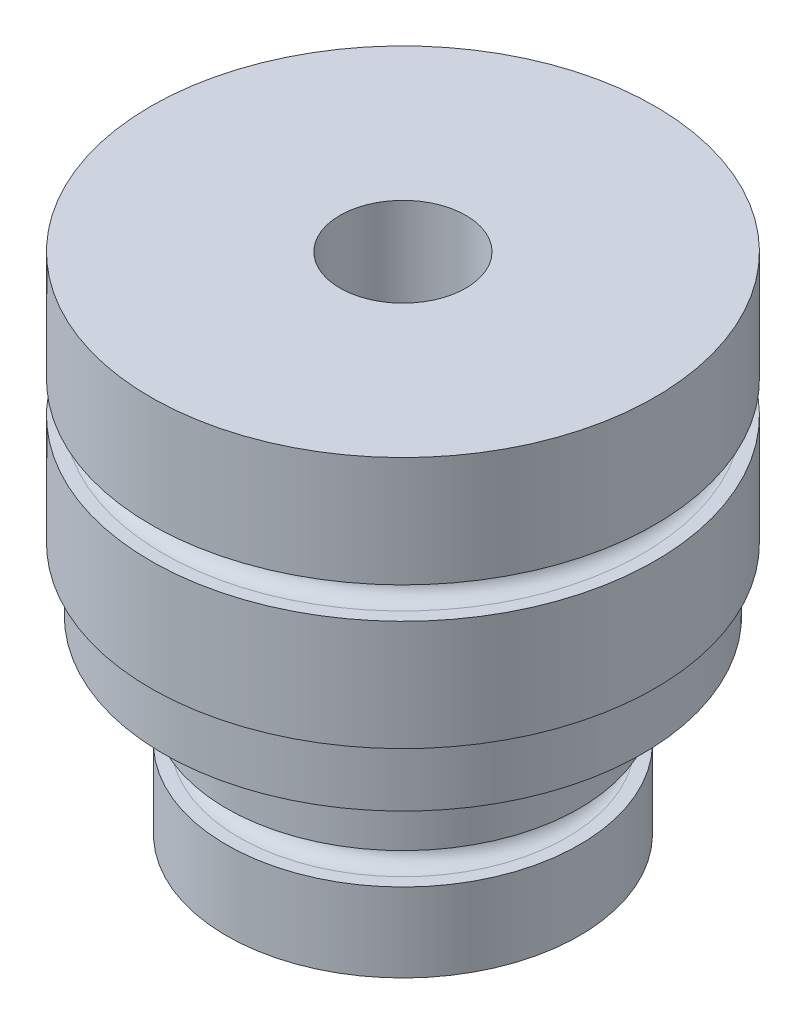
from build123d import *


with BuildPart() as part:
    # Sketch1 → Revolve1 (revolve)
    with BuildSketch(Plane.XY):
        with BuildLine():
            Line((0, 0), (-15, 0))
            Line((-15, 0), (-15, -8.75))
            Line((-15, -8.75), (-14, -8.75))
            ThreePointArc((-14, -8.75), (-12.75, -10), (-14, -11.25))
            Line((-14, -11.25), (-15, -11.25))
            Line((-15, -11.25), (-15, -20))
            Line((-15, -20), (-14, -20))
            Line((-14, -20), (-14, -25))
            Line((-14, -25), (-9, -25))
            Line((-9, -25), (-9, -31.25))
            Line((-9, -31.25), (-8, -31.25))
            ThreePointArc((-8, -31.25), (-6.75, -32.5), (-8, -33.75))
            Line((-8, -33.75), (-9, -33.75))
            Line((-9, -33.75), (-9, -40))
            Line((-9, -40), (-2, -40))
            Line((-2, -40), (0, -38))
            Line((0, -38), (0, 0))
        make_face()
    revolve(axis=Axis((5, 2.958560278, 0), (0, -1, 0)))


solid = part.part
